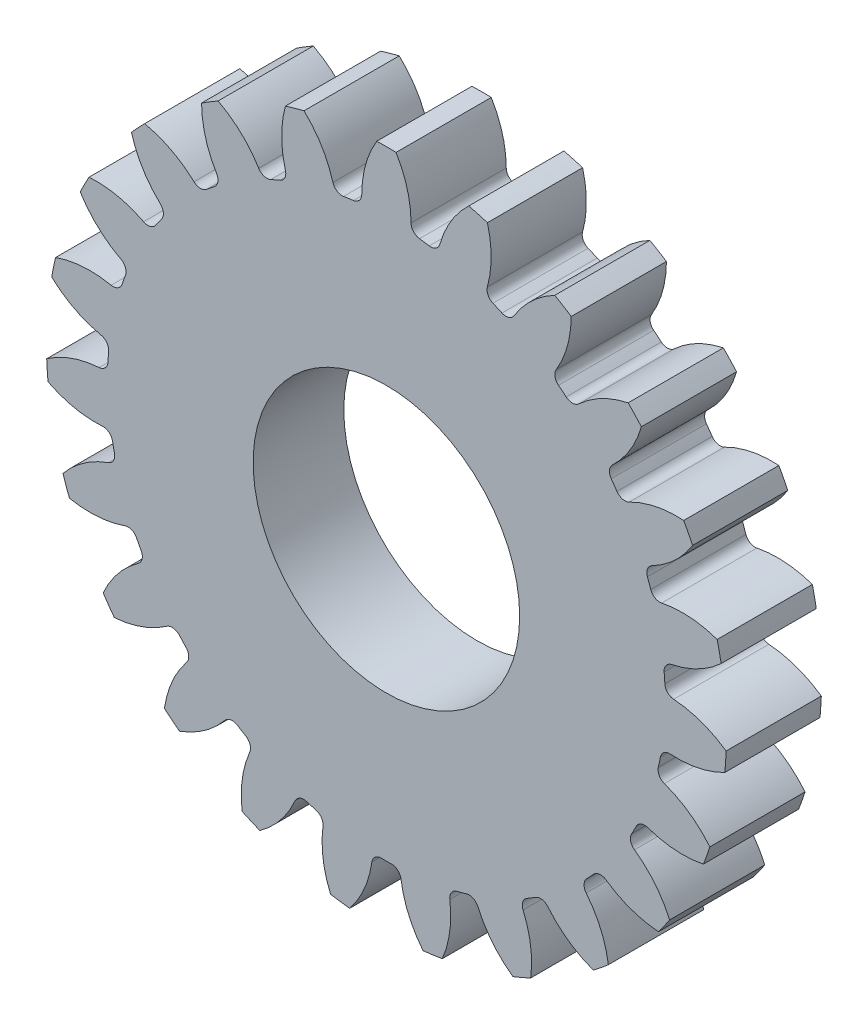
from build123d import *

# Parameters (mm, degrees)
BOSS_EXTRU_1_DEPTH                 = 10.5
CONG_1_R                           = 1.05
R_P_TITION_CIRCULAIRE4_COUNT       = 23
CONG_1_OF_R_P_TITION_CIRCULAIRE4_R = 1.05
ESQUISSE6_R                        = 14.7
ENL_V_MAT_EXTRU_2_DEPTH            = 10.5
ESQUISSE7_R                        = 17
ENL_V_MAT_EXTRU_3_DEPTH            = 0.5


with BuildPart() as part:
    # Esquisse3 → Boss.-Extru.1 (new body)
    with BuildSketch(Plane.XY):
        with BuildLine():
            Line((-5.565831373, 29.903240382), (-1.378706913, -0.560352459))
            Line((-1.378706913, -0.560352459), (2.808417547, 29.903240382))
            ThreePointArc((2.808417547, 29.903240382), (2.057480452, 29.99705444), (1.304462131, 30.072360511))
            ThreePointArc((1.304462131, 30.072360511), (1.033463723, 33.625238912), (-0.312405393, 36.92448449))
            ThreePointArc((-0.312405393, 36.92448449), (-1.378706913, 36.939647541), (-2.445008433, 36.92448449))
            ThreePointArc((-2.445008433, 36.92448449), (-3.790877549, 33.625238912), (-4.061875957, 30.072360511))
            ThreePointArc((-4.061875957, 30.072360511), (-4.814894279, 29.99705444), (-5.565831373, 29.903240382))
        make_face()
    boss_extru_1 = extrude(amount=BOSS_EXTRU_1_DEPTH)

    # Cong_1
    cong_1_edges = [part.edges().sort_by_distance(p)[0] for p in [
        (-4.061875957, 30.072360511, 5.25),
        (1.304462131, 30.072360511, 5.25),
    ]]
    fillet(cong_1_edges, radius=CONG_1_R)

    # R_p_tition circulaire4: Boss.-Extru.1 ×23 about axis
    r_p_tition_circulaire4_axis = Axis((-1.378706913, -0.560352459, 0), (0, 0, 1))
    for i in range(1, R_P_TITION_CIRCULAIRE4_COUNT):
        add(boss_extru_1.rotate(r_p_tition_circulaire4_axis, i * 360 / R_P_TITION_CIRCULAIRE4_COUNT))

    # Cong_1 of R_p_tition circulaire4
    cong_1_of_r_p_tition_circulaire4_edges = [part.edges().sort_by_distance(p)[0] for p in [
        (-12.226983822, 28.212506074, 5.25),
        (-7.059644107, 29.660326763, 5.25),
        (-19.587524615, 24.218700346, 5.25),
        (-15.002421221, 27.006963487, 5.25),
        (-25.5976007, 18.387145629, 5.25),
        (-21.93478977, 22.3090585, 5.25),
        (-29.811472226, 11.150341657, 5.25),
        (-27.342607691, 15.915033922, 5.25),
        (-31.91661562, 3.045009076, 5.25),
        (-30.824801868, 8.299105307, 5.25),
        (-31.756902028, -5.327716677, 5.25),
        (-32.12311389, 0.026111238, 5.25),
        (-29.344176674, -13.346868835, 5.25),
        (-31.141253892, -8.29037816, 5.25),
        (-24.857380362, -20.417703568, 5.25),
        (-27.952041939, -16.033566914, 5.25),
        (-18.629278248, -26.01580941, 5.25),
        (-22.792007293, -22.629178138, 5.25),
        (-11.121780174, -29.726000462, 5.25),
        (-16.043846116, -27.588045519, 5.25),
        (-2.891682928, -31.273108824, 5.25),
        (-8.208038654, -30.542392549, 5.25),
        (5.450624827, -30.542392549, 5.25),
        (0.134269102, -31.273108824, 5.25),
        (13.28643229, -27.588045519, 5.25),
        (8.364366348, -29.726000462, 5.25),
        (20.034593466, -22.629178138, 5.25),
        (15.871864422, -26.01580941, 5.25),
        (25.194628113, -16.033566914, 5.25),
        (22.099966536, -20.417703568, 5.25),
        (28.383840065, -8.29037816, 5.25),
        (26.586762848, -13.346868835, 5.25),
        (29.365700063, 0.026111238, 5.25),
        (28.999488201, -5.327716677, 5.25),
        (28.067388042, 8.299105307, 5.25),
        (29.159201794, 3.045009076, 5.25),
        (24.585193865, 15.915033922, 5.25),
        (27.0540584, 11.150341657, 5.25),
        (19.177375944, 22.3090585, 5.25),
        (22.840186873, 18.387145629, 5.25),
        (12.245007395, 27.006963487, 5.25),
        (16.830110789, 24.218700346, 5.25),
        (4.30223028, 29.660326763, 5.25),
        (9.469569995, 28.212506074, 5.25),
    ]]
    fillet(cong_1_of_r_p_tition_circulaire4_edges, radius=CONG_1_OF_R_P_TITION_CIRCULAIRE4_R)

    # Esquisse6 → Enl_v. mat.-Extru.2 (cut)
    with BuildSketch(Plane.XY.offset(10.5)):
        with Locations((-1.378706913, -0.560352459)):
            Circle(ESQUISSE6_R)
    extrude(amount=-ENL_V_MAT_EXTRU_2_DEPTH, mode=Mode.SUBTRACT)

    # Esquisse7 → Enl_v. mat.-Extru.3 (cut)
    with BuildSketch(Plane(origin=(0, 0, 0), x_dir=(-1, 0, 0), z_dir=(0, 0, -1))):
        with Locations((1.378706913, -0.560352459)):
            Circle(ESQUISSE7_R)
    extrude(amount=-ENL_V_MAT_EXTRU_3_DEPTH, mode=Mode.SUBTRACT)


solid = part.part
